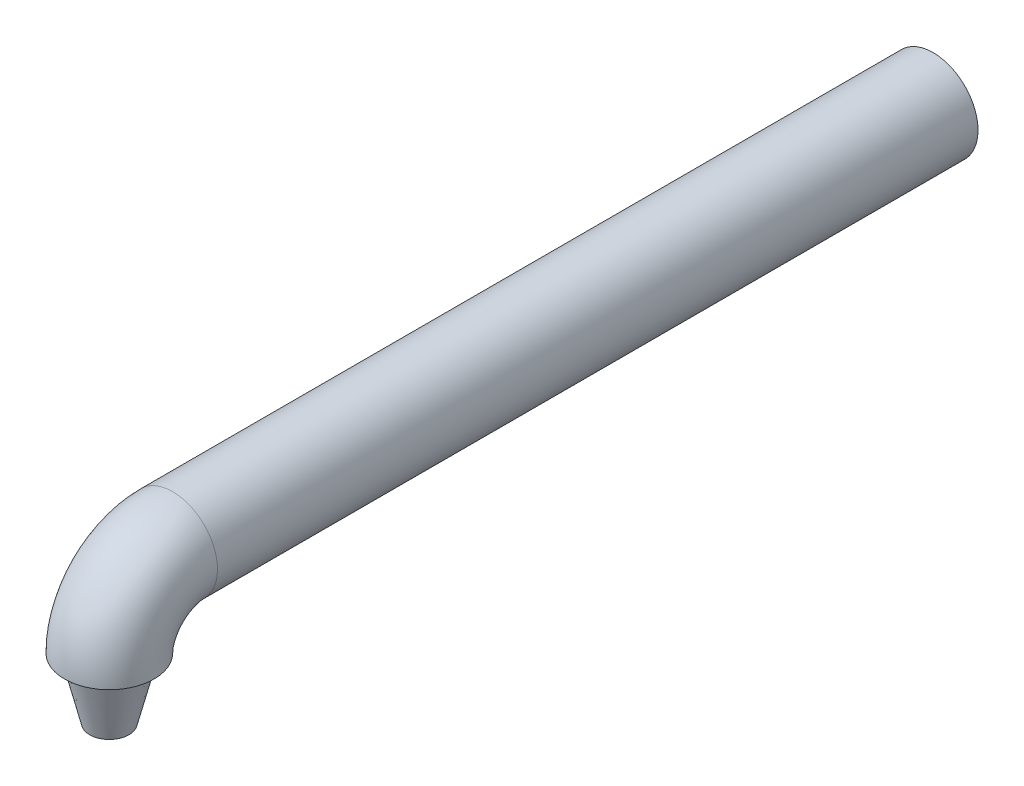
from build123d import *

# Parameters (mm, degrees)
SKETCH2_R           = 4.49072
SKETCH3_R           = 3.4925
BOSS_EXTRUDE1_DEPTH = 6.096
BOSS_EXTRUDE1_TAPER = 14


with BuildPart() as part:
    # Sweep2: sweep along a path in Sketch1
    with BuildLine(Plane(origin=(0, 0, 0), x_dir=(0, 0, -1), z_dir=(1, 0, 0))) as sweep2_path:
        Line((82.55, 6.35), (6.35, 6.35))
        ThreePointArc((6.35, 6.35), (1.859871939, 4.490128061), (0, 0))
    # Sketch2 → Sweep2 (sweep)
    with BuildSketch(Plane(origin=(0, 0, 0), x_dir=(1, 0, 0), z_dir=(0, 1, 0))):
        Circle(SKETCH2_R)
    sweep(path=sweep2_path.line)

    # Sketch3 → Boss-Extrude1 (add)
    with BuildSketch(Plane.XZ):
        Circle(SKETCH3_R)
    extrude(amount=BOSS_EXTRUDE1_DEPTH, taper=BOSS_EXTRUDE1_TAPER)


solid = part.part
